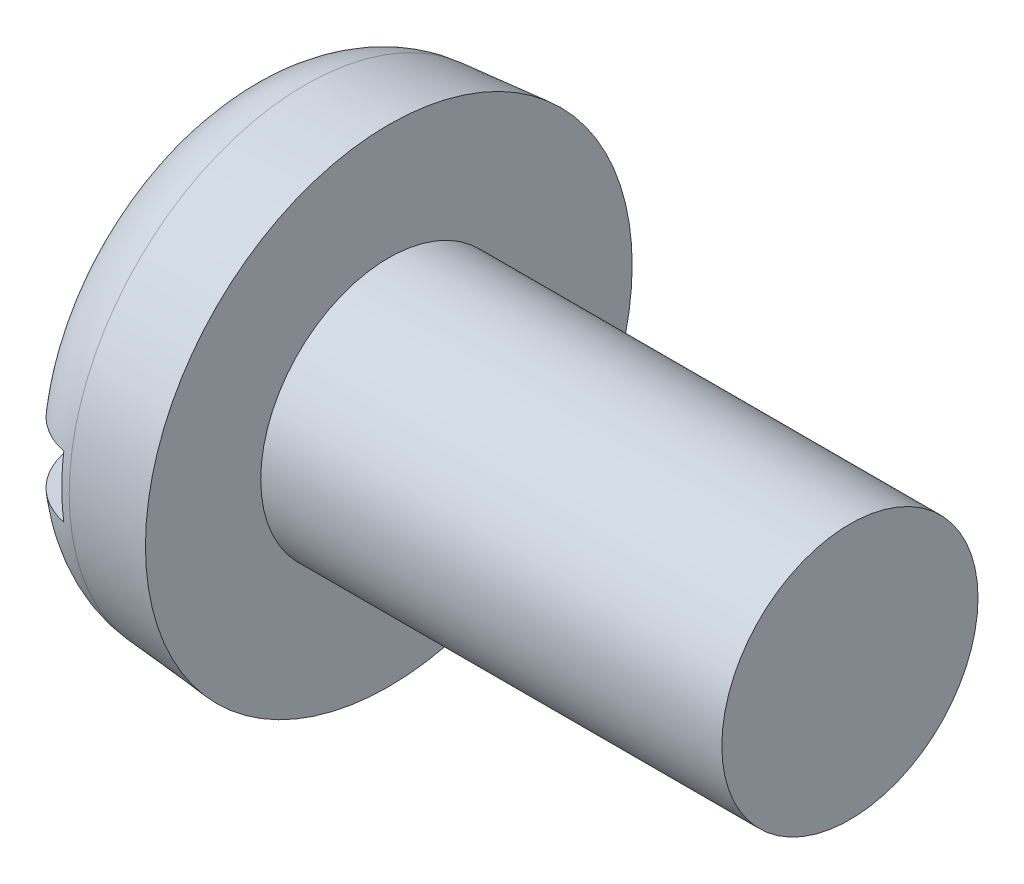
from build123d import *

# Parameters (mm, degrees)
FILLET2_R  = 1.5
SKETCH2_W  = 9.5
SKETCH2_H  = 1.2
SLOT_DEPTH = 1.2


with BuildPart() as part:
    # BodySke → Base-Revolve (revolve)
    with BuildSketch(Plane.XY, mode=Mode.PRIVATE) as base_revolve_sk:
        Polygon((3, 2.5), (3, 4.75), (0, 4.487534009), (0, 0), (12, 0), (12, 2.5), align=None)
    revolve(base_revolve_sk.sketch.rotate(Axis((-25.4, 0, 0), (1, 0, 0)), 90), axis=Axis((-25.4, 0, 0), (1, 0, 0)))

    # Fillet2
    fillet2_edges = [part.edges().sort_by_distance(p)[0] for p in [
        (0, 0, -4.487534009),
    ]]
    fillet(fillet2_edges, radius=FILLET2_R)

    # Sketch2 → Slot (cut)
    with BuildSketch(Plane(origin=(0, 0, 0), x_dir=(0, 0, -1), z_dir=(1, 0, 0))):
        Rectangle(SKETCH2_W, SKETCH2_H)
    extrude(amount=SLOT_DEPTH, mode=Mode.SUBTRACT)


solid = part.part
